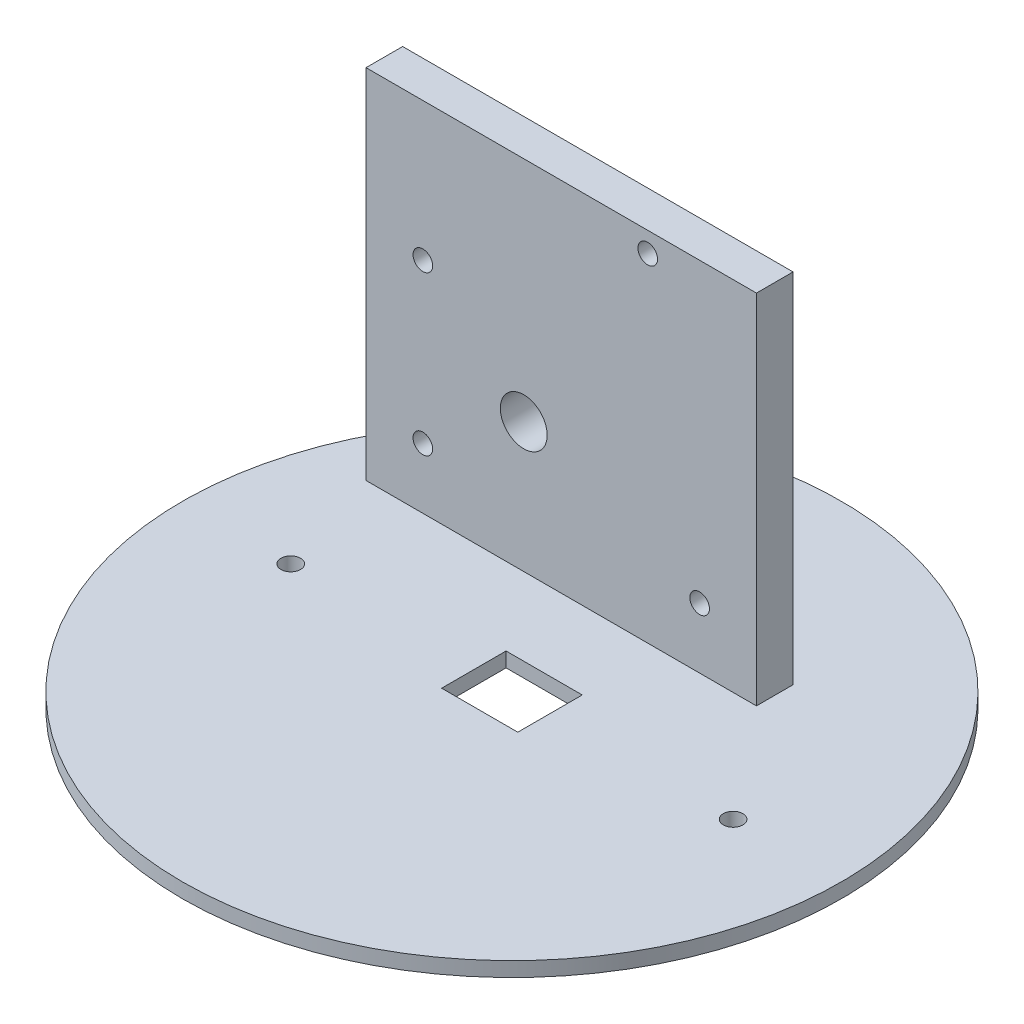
from build123d import *

# Parameters (mm, degrees)
SKETCH3_R                     = 57.15
BOSS_EXTRUDE1_DEPTH           = 2.54
SKETCH4_W                     = 13.208
SKETCH4_H                     = 11.176
CUT_EXTRUDE1_DEPTH            = 81.862207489
SKETCH5_W                     = 67.69989
SKETCH5_H                     = 6.35
BOSS_EXTRUDE2_DEPTH           = 61.99886
M3_CLEARANCE_HOLE1_AT_2_COUNT = 2
M3_CLEARANCE_HOLE1_AT_2_PITCH = 76.708
SKETCH8_R                     = 4.064
CUT_EXTRUDE2_DEPTH            = 120.356145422
M3_CLEARANCE_HOLE2_AT_2_COUNT = 2
M3_CLEARANCE_HOLE2_AT_2_PITCH = 27.4999958
M3_CLEARANCE_HOLE2_AT_3_COUNT = 2
M3_CLEARANCE_HOLE2_AT_3_PITCH = 61.845628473
M3_CLEARANCE_HOLE2_AT_4_COUNT = 2
M3_CLEARANCE_HOLE2_AT_4_PITCH = 47.99988876


with BuildPart() as part:
    # Sketch3 → Boss-Extrude1 (new body)
    with BuildSketch(Plane(origin=(0, 0, 0), x_dir=(1, 0, 0), z_dir=(0, 1, 0))):
        with Locations(Location((0, 0, 0), (0, 0, 270))):
            Circle(SKETCH3_R)
    extrude(amount=BOSS_EXTRUDE1_DEPTH)

    # Sketch4 → Cut-Extrude1 (cut, through all)
    with BuildSketch(Plane(origin=(0, 2.54, 0), x_dir=(1, 0, 0), z_dir=(0, 1, 0))):
        Rectangle(SKETCH4_W, SKETCH4_H)
    extrude(amount=-CUT_EXTRUDE1_DEPTH, mode=Mode.SUBTRACT)

    # Sketch5 → Boss-Extrude2 (add)
    with BuildSketch(Plane(origin=(0, 2.54, 0), x_dir=(1, 0, 0), z_dir=(0, 1, 0))):
        with Locations((-10.499979, 22.225)):
            Rectangle(SKETCH5_W, SKETCH5_H)
    extrude(amount=BOSS_EXTRUDE2_DEPTH)

    # Sketch7 → M3 Clearance Hole1 (revolve, cut)
    with BuildSketch(Plane(origin=(38.354, 2.54, 0), x_dir=(0, 0, 1), z_dir=(1, 0, 0))):
        Polygon((0, 0), (0, 2.54), (1.725, 2.54), (1.7, 2.515), (1.7, 0), align=None)
    m3_clearance_hole1 = revolve(axis=Axis((38.354, 8.89, 0), (0, -1, 0)), mode=Mode.SUBTRACT)

    # M3 Clearance Hole1 at 2: M3 Clearance Hole1 ×2
    with Locations(*[(-i * M3_CLEARANCE_HOLE1_AT_2_PITCH, 0, 0) for i in range(1, M3_CLEARANCE_HOLE1_AT_2_COUNT)]):
        add(m3_clearance_hole1, mode=Mode.SUBTRACT)

    # Sketch8 → Cut-Extrude2 (cut, through all)
    with BuildSketch(Plane(origin=(0, 0, -25.4), x_dir=(-1, 0, 0), z_dir=(0, 0, -1))):
        with Locations((16.999966, 25.04000072)):
            Circle(SKETCH8_R)
    extrude(amount=-CUT_EXTRUDE2_DEPTH, mode=Mode.SUBTRACT)

    # Sketch13 → M3 Clearance Hole2 (revolve, cut)
    with BuildSketch(Plane(origin=(-34.49992338, 13.040000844, -19.05), x_dir=(0, -1, 0), z_dir=(1, 0, 0))):
        Polygon((0, 0), (0, 6.35), (1.725, 6.35), (1.7, 6.325), (1.7, 0), align=None)
    m3_clearance_hole2 = revolve(axis=Axis((-34.49992338, 13.040000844, -12.7), (0, 0, -1)), mode=Mode.SUBTRACT)

    # M3 Clearance Hole2 at 2: M3 Clearance Hole2 ×2
    with Locations(*[(0, i * M3_CLEARANCE_HOLE2_AT_2_PITCH, 0) for i in range(1, M3_CLEARANCE_HOLE2_AT_2_COUNT)]):
        add(m3_clearance_hole2, mode=Mode.SUBTRACT)

    # M3 Clearance Hole2 at 3: M3 Clearance Hole2 ×2
    with Locations(*[Vector(0.6306005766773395, 0.7761075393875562, 0) * (i * M3_CLEARANCE_HOLE2_AT_3_PITCH) for i in range(1, M3_CLEARANCE_HOLE2_AT_3_COUNT)]):
        add(m3_clearance_hole2, mode=Mode.SUBTRACT)

    # M3 Clearance Hole2 at 4: M3 Clearance Hole2 ×2
    with Locations(*[(i * M3_CLEARANCE_HOLE2_AT_4_PITCH, 0, 0) for i in range(1, M3_CLEARANCE_HOLE2_AT_4_COUNT)]):
        add(m3_clearance_hole2, mode=Mode.SUBTRACT)


solid = part.part
